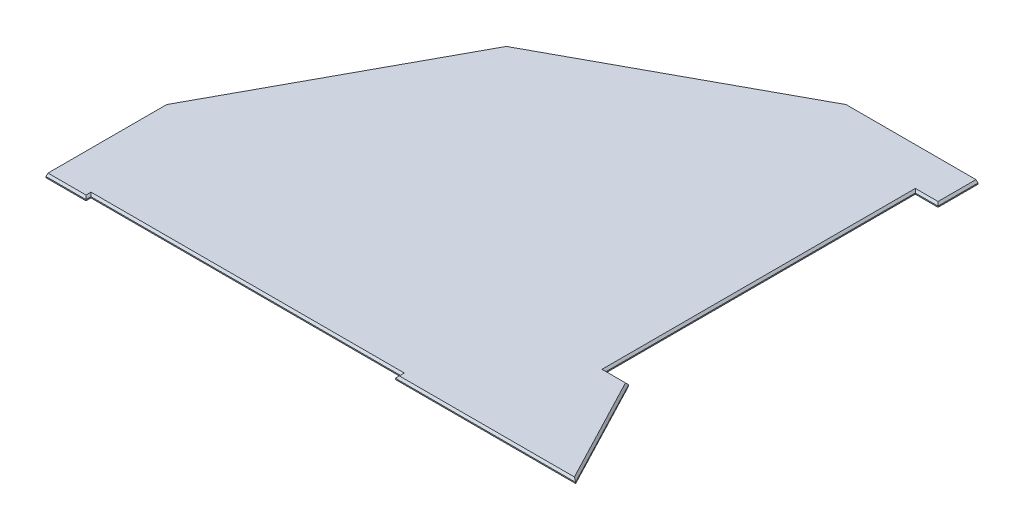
from build123d import *

# Parameters (mm, degrees)
BOSS_EXTRUDE2_DEPTH = 6.35
CHAMFER1_SIZE       = 5


with BuildPart() as part:
    # Sketch2 → Boss-Extrude2 (new, symmetric)
    with BuildSketch(Plane(origin=(0, 0, 0), x_dir=(-1, 0, 0), z_dir=(0, 1, 0))):
        Polygon((604.715914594, 547.712647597), (604.715914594, 560.237647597), (704.715914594, 560.237647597), (704.715914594, 258.331543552), (405.744758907, -292.581496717), (-145.168281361, -591.552652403), (-475.296585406, -591.552652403), (-475.296585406, -491.552652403), (-418.496585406, -491.552652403), (-418.496585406, 282.447347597), (-475.296585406, 282.447347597), (-620.484085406, 560.237647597), (-169.284085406, 560.237647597), (-169.284085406, 547.712647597), align=None)
    extrude(amount=BOSS_EXTRUDE2_DEPTH, both=True)

    # Chamfer1
    chamfer1_edges = [part.edges().sort_by_distance(p)[0] for p in [
        (475.296585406, -6.35, -541.552652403),
        (446.896585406, -6.35, -491.552652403),
        (418.496585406, -6.35, -104.552652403),
        (446.896585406, -6.35, 282.447347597),
        (547.890335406, -6.35, 421.342497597),
        (394.884085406, -6.35, 560.237647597),
        (169.284085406, -6.35, 553.975147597),
        (-654.715914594, 6.35, 560.237647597),
        (-217.715914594, -6.35, 547.712647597),
        (-604.715914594, -6.35, 553.975147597),
        (-654.715914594, -6.35, 560.237647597),
        (-604.715914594, 6.35, 553.975147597),
        (-217.715914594, 6.35, 547.712647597),
        (169.284085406, 6.35, 553.975147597),
        (394.884085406, 6.35, 560.237647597),
        (547.890335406, 6.35, 421.342497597),
        (446.896585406, 6.35, 282.447347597),
        (418.496585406, 6.35, -104.552652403),
        (446.896585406, 6.35, -491.552652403),
        (475.296585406, 6.35, -541.552652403),
    ]]
    chamfer(chamfer1_edges, length=CHAMFER1_SIZE)


solid = part.part
